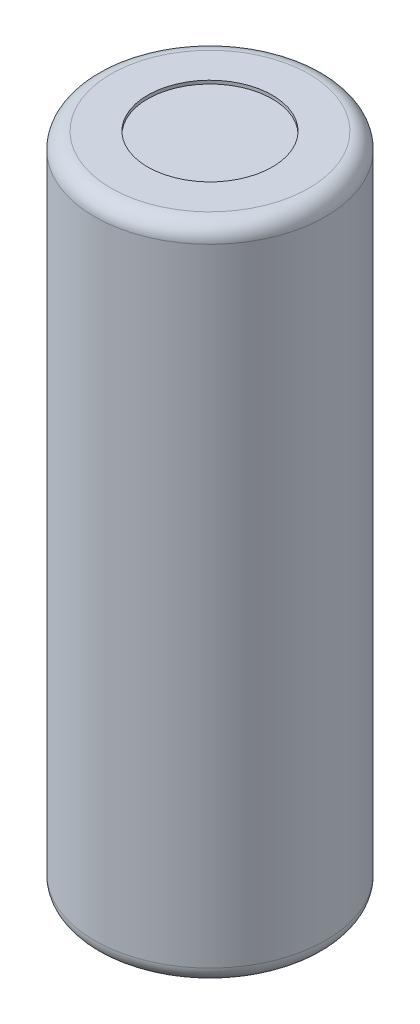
ISO-10303-21;
HEADER;
FILE_DESCRIPTION(('STEP AP214'),'2;1');
FILE_NAME('part.step','',(''),(''),'','','');
FILE_SCHEMA(('AUTOMOTIVE_DESIGN { 1 0 10303 214 1 1 1 1 }'));
ENDSEC;
DATA;
#1=APPLICATION_CONTEXT('core data for automotive mechanical design processes');
#2=APPLICATION_PROTOCOL_DEFINITION('international standard','automotive_design',2000,#1);
#3=PRODUCT_CONTEXT('',#1,'mechanical');
#4=PRODUCT('Part','Part','',(#3));
#5=PRODUCT_RELATED_PRODUCT_CATEGORY('part','',(#4));
#6=PRODUCT_DEFINITION_FORMATION('','',#4);
#7=PRODUCT_DEFINITION_CONTEXT('part definition',#1,'design');
#8=PRODUCT_DEFINITION('design','',#6,#7);
#9=PRODUCT_DEFINITION_SHAPE('','',#8);
#10=(LENGTH_UNIT() NAMED_UNIT(*) SI_UNIT(.MILLI.,.METRE.));
#11=(NAMED_UNIT(*) PLANE_ANGLE_UNIT() SI_UNIT($,.RADIAN.));
#12=(NAMED_UNIT(*) SI_UNIT($,.STERADIAN.) SOLID_ANGLE_UNIT());
#13=UNCERTAINTY_MEASURE_WITH_UNIT(LENGTH_MEASURE(1.E-05),#10,'distance_accuracy_value','');
#14=(GEOMETRIC_REPRESENTATION_CONTEXT(3) GLOBAL_UNCERTAINTY_ASSIGNED_CONTEXT((#13)) GLOBAL_UNIT_ASSIGNED_CONTEXT((#10,
#11,#12)) REPRESENTATION_CONTEXT('',''));
#15=CARTESIAN_POINT('',(0.,0.,0.));
#16=DIRECTION('',(0.,0.,1.));
#17=DIRECTION('',(1.,0.,0.));
#18=AXIS2_PLACEMENT_3D('',#15,#16,#17);
#19=CARTESIAN_POINT('',(0.,19.9,0.));
#20=DIRECTION('',(0.,1.,0.));
#21=DIRECTION('',(0.,0.,1.));
#22=AXIS2_PLACEMENT_3D('',#19,#20,#21);
#23=PLANE('',#22);
#24=CARTESIAN_POINT('',(0.,19.9,0.));
#25=DIRECTION('',(0.,1.,0.));
#26=DIRECTION('',(0.,0.,1.));
#27=AXIS2_PLACEMENT_3D('',#24,#25,#26);
#28=CIRCLE('',#27,1.8883417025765);
#29=CARTESIAN_POINT('',(0.,19.9,1.8883417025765));
#30=VERTEX_POINT('',#29);
#31=EDGE_CURVE('E194',#30,#30,#28,.T.);
#32=ORIENTED_EDGE('',*,*,#31,.T.);
#33=EDGE_LOOP('',(#32));
#34=FACE_BOUND('',#33,.T.);
#35=ADVANCED_FACE('F17',(#34),#23,.T.);
#36=CARTESIAN_POINT('',(0.,19.9,0.));
#37=DIRECTION('',(0.,1.,0.));
#38=DIRECTION('',(0.,0.,1.));
#39=AXIS2_PLACEMENT_3D('',#36,#37,#38);
#40=CYLINDRICAL_SURFACE('',#39,1.8883417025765);
#41=CARTESIAN_POINT('',(0.,20.,0.));
#42=DIRECTION('',(0.,1.,0.));
#43=DIRECTION('',(0.,0.,1.));
#44=AXIS2_PLACEMENT_3D('',#41,#42,#43);
#45=CIRCLE('',#44,1.8883417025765);
#46=CARTESIAN_POINT('',(0.,20.,1.8883417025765));
#47=VERTEX_POINT('',#46);
#48=EDGE_CURVE('E53',#47,#47,#45,.F.);
#49=ORIENTED_EDGE('',*,*,#48,.F.);
#50=EDGE_LOOP('',(#49));
#51=FACE_BOUND('',#50,.T.);
#52=ORIENTED_EDGE('',*,*,#31,.F.);
#53=EDGE_LOOP('',(#52));
#54=FACE_BOUND('',#53,.T.);
#55=ADVANCED_FACE('F123',(#51,#54),#40,.F.);
#56=CARTESIAN_POINT('',(0.,20.,0.));
#57=DIRECTION('',(0.,1.,0.));
#58=DIRECTION('',(0.,0.,1.));
#59=AXIS2_PLACEMENT_3D('',#56,#57,#58);
#60=PLANE('',#59);
#61=CARTESIAN_POINT('',(0.,20.,0.));
#62=DIRECTION('',(0.,-1.,0.));
#63=DIRECTION('',(0.,0.,-1.));
#64=AXIS2_PLACEMENT_3D('',#61,#62,#63);
#65=CIRCLE('',#64,3.);
#66=CARTESIAN_POINT('',(0.,20.,-3.));
#67=VERTEX_POINT('',#66);
#68=CARTESIAN_POINT('',(0.,20.,3.));
#69=VERTEX_POINT('',#68);
#70=EDGE_CURVE('E51',#67,#69,#65,.T.);
#71=ORIENTED_EDGE('',*,*,#70,.F.);
#72=CARTESIAN_POINT('',(0.,20.,0.));
#73=DIRECTION('',(0.,-1.,0.));
#74=DIRECTION('',(0.,0.,1.));
#75=AXIS2_PLACEMENT_3D('',#72,#73,#74);
#76=CIRCLE('',#75,3.);
#77=EDGE_CURVE('E45',#69,#67,#76,.T.);
#78=ORIENTED_EDGE('',*,*,#77,.F.);
#79=EDGE_LOOP('',(#71,#78));
#80=FACE_BOUND('',#79,.T.);
#81=ORIENTED_EDGE('',*,*,#48,.T.);
#82=EDGE_LOOP('',(#81));
#83=FACE_BOUND('',#82,.T.);
#84=ADVANCED_FACE('F49',(#80,#83),#60,.T.);
#85=CARTESIAN_POINT('',(0.,0.,0.));
#86=DIRECTION('',(0.,1.,0.));
#87=DIRECTION('',(0.,0.,1.));
#88=AXIS2_PLACEMENT_3D('',#85,#86,#87);
#89=PLANE('',#88);
#90=CARTESIAN_POINT('',(0.,0.,0.));
#91=DIRECTION('',(0.,1.,0.));
#92=DIRECTION('',(0.,0.,1.));
#93=AXIS2_PLACEMENT_3D('',#90,#91,#92);
#94=CIRCLE('',#93,3.);
#95=CARTESIAN_POINT('',(0.,0.,3.));
#96=VERTEX_POINT('',#95);
#97=CARTESIAN_POINT('',(0.,0.,-3.));
#98=VERTEX_POINT('',#97);
#99=EDGE_CURVE('E59',#96,#98,#94,.T.);
#100=ORIENTED_EDGE('',*,*,#99,.F.);
#101=CARTESIAN_POINT('',(0.,0.,0.));
#102=DIRECTION('',(0.,1.,0.));
#103=DIRECTION('',(0.,0.,-1.));
#104=AXIS2_PLACEMENT_3D('',#101,#102,#103);
#105=CIRCLE('',#104,3.);
#106=EDGE_CURVE('E36',#98,#96,#105,.T.);
#107=ORIENTED_EDGE('',*,*,#106,.F.);
#108=EDGE_LOOP('',(#100,#107));
#109=FACE_BOUND('',#108,.T.);
#110=ADVANCED_FACE('F79',(#109),#89,.F.);
#111=CARTESIAN_POINT('',(0.,19.5,0.));
#112=DIRECTION('',(0.,1.,0.));
#113=DIRECTION('',(0.,0.,1.));
#114=AXIS2_PLACEMENT_3D('',#111,#112,#113);
#115=TOROIDAL_SURFACE('',#114,3.,0.5);
#116=ORIENTED_EDGE('',*,*,#77,.T.);
#117=ORIENTED_EDGE('',*,*,#70,.T.);
#118=EDGE_LOOP('',(#116,#117));
#119=FACE_BOUND('',#118,.T.);
#120=CARTESIAN_POINT('',(0.,19.5,0.));
#121=DIRECTION('',(0.,-1.,0.));
#122=DIRECTION('',(0.,0.,-1.));
#123=AXIS2_PLACEMENT_3D('',#120,#121,#122);
#124=CIRCLE('',#123,3.5);
#125=CARTESIAN_POINT('',(0.,19.5,-3.5));
#126=VERTEX_POINT('',#125);
#127=EDGE_CURVE('E28',#126,#126,#124,.T.);
#128=ORIENTED_EDGE('',*,*,#127,.F.);
#129=EDGE_LOOP('',(#128));
#130=FACE_BOUND('',#129,.T.);
#131=ADVANCED_FACE('F57',(#119,#130),#115,.T.);
#132=CARTESIAN_POINT('',(0.,0.5,0.));
#133=DIRECTION('',(0.,1.,0.));
#134=DIRECTION('',(0.,0.,1.));
#135=AXIS2_PLACEMENT_3D('',#132,#133,#134);
#136=TOROIDAL_SURFACE('',#135,3.,0.5);
#137=CARTESIAN_POINT('',(0.,0.5,0.));
#138=DIRECTION('',(0.,-1.,0.));
#139=DIRECTION('',(0.,0.,-1.));
#140=AXIS2_PLACEMENT_3D('',#137,#138,#139);
#141=CIRCLE('',#140,3.5);
#142=CARTESIAN_POINT('',(0.,0.5,-3.5));
#143=VERTEX_POINT('',#142);
#144=EDGE_CURVE('E11',#143,#143,#141,.F.);
#145=ORIENTED_EDGE('',*,*,#144,.F.);
#146=EDGE_LOOP('',(#145));
#147=FACE_BOUND('',#146,.T.);
#148=ORIENTED_EDGE('',*,*,#99,.T.);
#149=ORIENTED_EDGE('',*,*,#106,.T.);
#150=EDGE_LOOP('',(#148,#149));
#151=FACE_BOUND('',#150,.T.);
#152=ADVANCED_FACE('F78',(#147,#151),#136,.T.);
#153=CARTESIAN_POINT('',(0.,20.,0.));
#154=DIRECTION('',(0.,-1.,0.));
#155=DIRECTION('',(0.,0.,-1.));
#156=AXIS2_PLACEMENT_3D('',#153,#154,#155);
#157=CYLINDRICAL_SURFACE('',#156,3.5);
#158=ORIENTED_EDGE('',*,*,#144,.T.);
#159=EDGE_LOOP('',(#158));
#160=FACE_BOUND('',#159,.T.);
#161=ORIENTED_EDGE('',*,*,#127,.T.);
#162=EDGE_LOOP('',(#161));
#163=FACE_BOUND('',#162,.T.);
#164=ADVANCED_FACE('F134',(#160,#163),#157,.T.);
#165=CLOSED_SHELL('',(#35,#55,#84,#110,#131,#152,#164));
#166=MANIFOLD_SOLID_BREP('B1',#165);
#167=ADVANCED_BREP_SHAPE_REPRESENTATION('',(#18,#166),#14);
#168=SHAPE_DEFINITION_REPRESENTATION(#9,#167);
ENDSEC;
END-ISO-10303-21;
